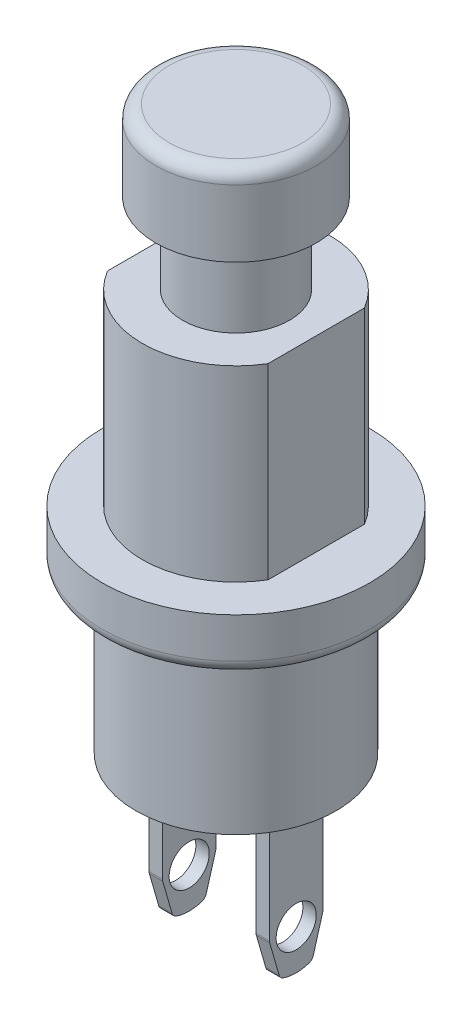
from build123d import *

# Parameters (mm, degrees)
SKETCH1_R          = 3.75
EXTRUDE1_DEPTH     = 6
SKETCH2_W          = 0.5
SKETCH2_H          = 3
EXTRUDE2_DEPTH     = 6
SKETCH3_R          = 0.75
CUT_EXTRUDE5_DEPTH = 10.276987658
SKETCH4_R          = 5
EXTRUDE3_DEPTH     = 2
FILLET1_R          = 0.5
EXTRUDE4_DEPTH     = 7
SKETCH6_R          = 2
EXTRUDE5_DEPTH     = 3
SKETCH7_R          = 3
EXTRUDE6_DEPTH     = 3
FILLET2_R          = 0.5


with BuildPart() as part:
    # Sketch1 → Extrude1 (new body)
    with BuildSketch(Plane(origin=(0, 0, 0), x_dir=(1, 0, 0), z_dir=(0, 1, 0))):
        with Locations(Location((0, 0, 0), (0, 0, 270))):
            Circle(SKETCH1_R)
    extrude(amount=EXTRUDE1_DEPTH)

    # Sketch2 → Extrude2 (add)
    with BuildSketch(Plane.XZ):
        with Locations((-2, 0)):
            Rectangle(SKETCH2_W, SKETCH2_H)
        with Locations((2, 0)):
            Rectangle(SKETCH2_W, SKETCH2_H)
    extrude(amount=EXTRUDE2_DEPTH)

    # Sketch3 → Cut-Extrude5 (cut, through all)
    with BuildSketch(Plane.ZY.offset(2.25)):
        with BuildLine():
            Line((-1, -0.5), (-1.5, -0.5))
            Line((-1.5, -0.5), (-1.5, -6))
            Line((-1.5, -6), (0, -6))
            ThreePointArc((0, -6), (-0.242130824, -5.980328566), (-0.477910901, -5.921830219))
            ThreePointArc((-0.477910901, -5.921830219), (-0.57884701, -5.857739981), (-0.638477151, -5.754106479))
            Line((-0.638477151, -5.754106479), (-0.990218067, -4.533933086))
            ThreePointArc((-0.990218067, -4.533933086), (-0.997542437, -4.499652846), (-1, -4.464685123))
            Line((-1, -4.464685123), (-1, -0.5))
        make_face()
        with Locations((0, -4.5)):
            Circle(SKETCH3_R)
        with BuildLine():
            ThreePointArc((0.477910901, -5.921830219), (0.242130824, -5.980328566), (0, -6))
            Line((0, -6), (1.5, -6))
            Line((1.5, -6), (1.5, -0.5))
            Line((1.5, -0.5), (1, -0.5))
            Line((1, -0.5), (1, -4.464685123))
            ThreePointArc((1, -4.464685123), (0.997542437, -4.499652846), (0.990218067, -4.533933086))
            Line((0.990218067, -4.533933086), (0.638477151, -5.754106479))
            ThreePointArc((0.638477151, -5.754106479), (0.57884701, -5.857739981), (0.477910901, -5.921830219))
        make_face()
    extrude(amount=-CUT_EXTRUDE5_DEPTH, mode=Mode.SUBTRACT)

    # Sketch4 → Extrude3 (add)
    with BuildSketch(Plane(origin=(0, 6, 0), x_dir=(-1, 0, 0), z_dir=(0, 1, 0))):
        with Locations(Location((0, 0, 0), (0, 0, 90))):
            Circle(SKETCH4_R)
    extrude(amount=EXTRUDE3_DEPTH)

    # Fillet1
    fillet1_edges = [part.edges().sort_by_distance(p)[0] for p in [
        (0, 6, -5),
    ]]
    fillet(fillet1_edges, radius=FILLET1_R)

    # Sketch5 → Extrude4 (add)
    with BuildSketch(Plane(origin=(0, 8, 0), x_dir=(-1, 0, 0), z_dir=(0, 1, 0))):
        with BuildLine():
            Line((-3, 1.802775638), (-3, -1.802775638))
            ThreePointArc((-3, -1.802775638), (0, -3.5), (3, -1.802775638))
            Line((3, -1.802775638), (3, 1.802775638))
            ThreePointArc((3, 1.802775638), (0, 3.5), (-3, 1.802775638))
        make_face()
    extrude(amount=EXTRUDE4_DEPTH)

    # Sketch6 → Extrude5 (add)
    with BuildSketch(Plane(origin=(0, 15, 0), x_dir=(-1, 0, 0), z_dir=(0, 1, 0))):
        with Locations(Location((0, 0, 0), (0, 0, 90))):
            Circle(SKETCH6_R)
    extrude(amount=EXTRUDE5_DEPTH)

    # Sketch7 → Extrude6 (add)
    with BuildSketch(Plane(origin=(0, 18, 0), x_dir=(-1, 0, 0), z_dir=(0, 1, 0))):
        with Locations(Location((0, 0, 0), (0, 0, 90))):
            Circle(SKETCH7_R)
    extrude(amount=EXTRUDE6_DEPTH)

    # Fillet2
    fillet2_edges = [part.edges().sort_by_distance(p)[0] for p in [
        (0, 21, -3),
    ]]
    fillet(fillet2_edges, radius=FILLET2_R)


solid = part.part
